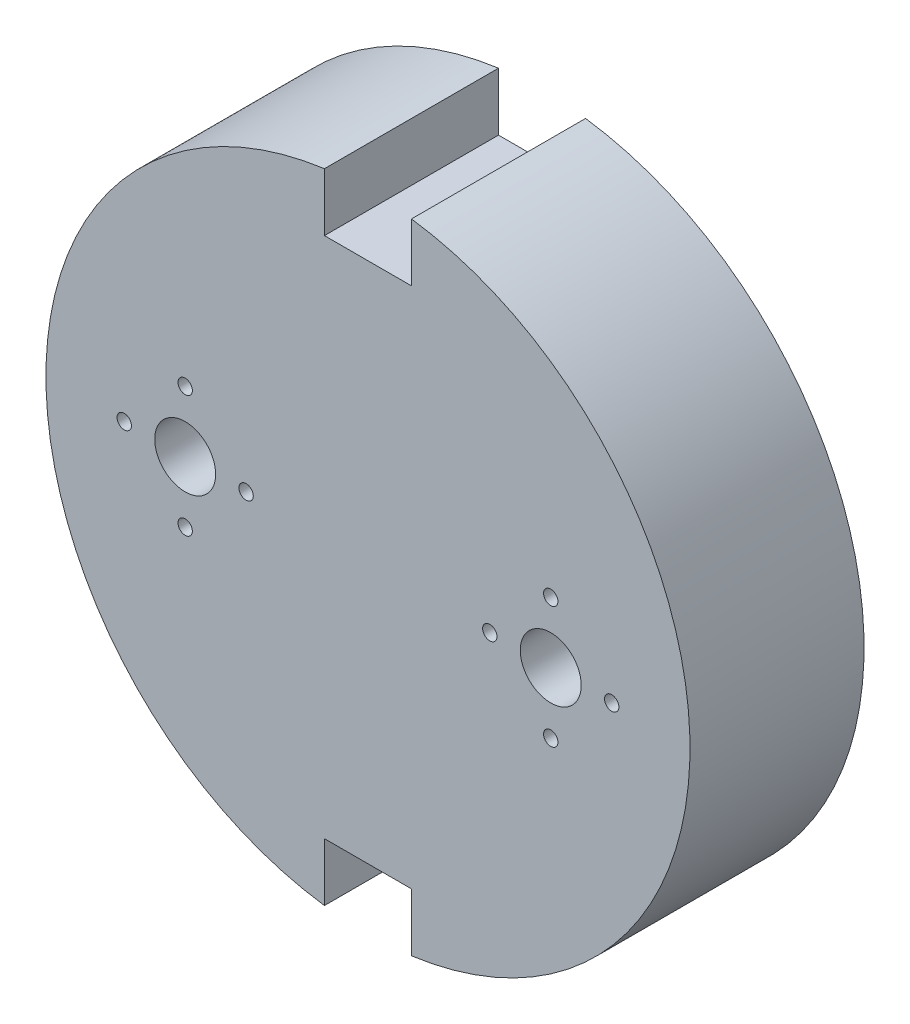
from build123d import *

# Parameters (mm, degrees)
ESQUISSE1_R           = 7
EXTRUSION1_DEPTH      = 40
ESQUISSE2_R           = 15
EXTRUSION2_DEPTH      = 12
CHANFREIN1_SIZE       = 2
TROU_TARAUD_M41_D     = 3.3
TROU_TARAUD_M41_DEPTH = 50
TROU_TARAUD_M41_TIP   = 0.991420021


with BuildPart() as part:
    # Esquisse1 → Extrusion1 (new body)
    with BuildSketch(Plane.XY):
        with BuildLine():
            Line((-10, 73.321211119), (-10, 60))
            Line((-10, 60), (10, 60))
            Line((10, 60), (10, 73.321211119))
            ThreePointArc((10, 73.321211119), (74, 0), (10, -73.321211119))
            Line((10, -73.321211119), (10, -60))
            Line((10, -60), (-10, -60))
            Line((-10, -60), (-10, -73.321211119))
            ThreePointArc((-10, -73.321211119), (-74, 0), (-10, 73.321211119))
        make_face()
        with Locations((-42, 0)):
            Circle(ESQUISSE1_R, mode=Mode.SUBTRACT)
        with Locations((42, 0)):
            Circle(ESQUISSE1_R, mode=Mode.SUBTRACT)
    extrude(amount=EXTRUSION1_DEPTH)

    # Esquisse2 → Extrusion2 (add)
    with BuildSketch(Plane(origin=(0, 0, 0), x_dir=(-1, 0, 0), z_dir=(0, 0, -1))):
        with Locations(Location((0, 0, 0), (0, 0, 180))):
            Circle(ESQUISSE2_R)
    extrude(amount=EXTRUSION2_DEPTH)

    # Chanfrein1
    chanfrein1_edges = [part.edges().sort_by_distance(p)[0] for p in [
        (-15, 0, -12),
    ]]
    chamfer(chanfrein1_edges, length=CHANFREIN1_SIZE)

    # Trou taraud_ M41
    with Locations(Plane(origin=(-42, 14, 40), x_dir=(1, 0, 0), z_dir=(0, 0, 1))):
        with Locations((0, 0), (0, -28), (14, -14), (70, -14), (84, 0), (98, -14), (84, -28), (-14, -14)):
            Hole(TROU_TARAUD_M41_D / 2, depth=TROU_TARAUD_M41_DEPTH)
            with Locations((0, 0, -(TROU_TARAUD_M41_DEPTH + TROU_TARAUD_M41_TIP / 2))):  # 118° drill point
                Cone(0, TROU_TARAUD_M41_D / 2, TROU_TARAUD_M41_TIP, mode=Mode.SUBTRACT)


solid = part.part
